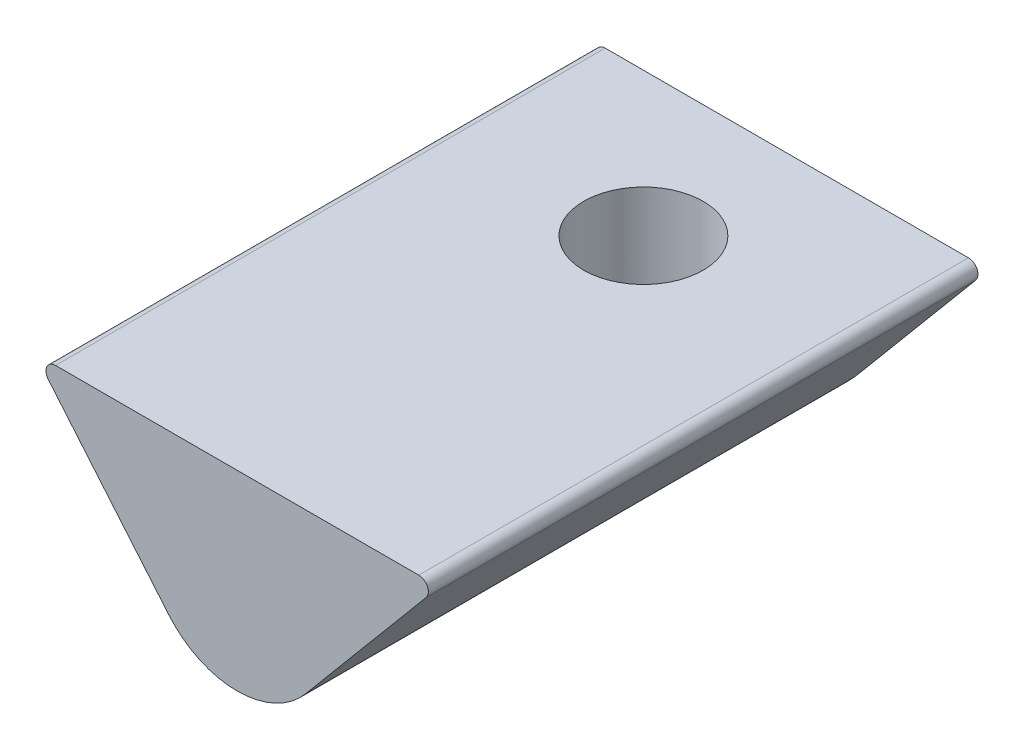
ISO-10303-21;
HEADER;
FILE_DESCRIPTION(('STEP AP214'),'2;1');
FILE_NAME('part.step','',(''),(''),'','','');
FILE_SCHEMA(('AUTOMOTIVE_DESIGN { 1 0 10303 214 1 1 1 1 }'));
ENDSEC;
DATA;
#1=APPLICATION_CONTEXT('core data for automotive mechanical design processes');
#2=APPLICATION_PROTOCOL_DEFINITION('international standard','automotive_design',2000,#1);
#3=PRODUCT_CONTEXT('',#1,'mechanical');
#4=PRODUCT('Part','Part','',(#3));
#5=PRODUCT_RELATED_PRODUCT_CATEGORY('part','',(#4));
#6=PRODUCT_DEFINITION_FORMATION('','',#4);
#7=PRODUCT_DEFINITION_CONTEXT('part definition',#1,'design');
#8=PRODUCT_DEFINITION('design','',#6,#7);
#9=PRODUCT_DEFINITION_SHAPE('','',#8);
#10=(LENGTH_UNIT() NAMED_UNIT(*) SI_UNIT(.MILLI.,.METRE.));
#11=(NAMED_UNIT(*) PLANE_ANGLE_UNIT() SI_UNIT($,.RADIAN.));
#12=(NAMED_UNIT(*) SI_UNIT($,.STERADIAN.) SOLID_ANGLE_UNIT());
#13=UNCERTAINTY_MEASURE_WITH_UNIT(LENGTH_MEASURE(1.E-05),#10,'distance_accuracy_value','');
#14=(GEOMETRIC_REPRESENTATION_CONTEXT(3) GLOBAL_UNCERTAINTY_ASSIGNED_CONTEXT((#13)) GLOBAL_UNIT_ASSIGNED_CONTEXT((#10,
#11,#12)) REPRESENTATION_CONTEXT('',''));
#15=CARTESIAN_POINT('',(0.,0.,0.));
#16=DIRECTION('',(0.,0.,1.));
#17=DIRECTION('',(1.,0.,0.));
#18=AXIS2_PLACEMENT_3D('',#15,#16,#17);
#19=CARTESIAN_POINT('',(0.,-2.1289115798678,11.5));
#20=DIRECTION('',(0.,0.,-1.));
#21=DIRECTION('',(-1.,0.,0.));
#22=AXIS2_PLACEMENT_3D('',#19,#20,#21);
#23=CYLINDRICAL_SURFACE('',#22,1.8710884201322);
#24=CARTESIAN_POINT('',(0.,-4.,4.24999999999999));
#25=CARTESIAN_POINT('',(0.0627778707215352,-4.0000005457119,4.25000064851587));
#26=CARTESIAN_POINT('',(0.125553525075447,-3.99681361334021,4.24524527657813));
#27=CARTESIAN_POINT('',(0.249101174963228,-3.98438454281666,4.22652207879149));
#28=CARTESIAN_POINT('',(0.309872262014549,-3.9751396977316,4.21255013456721));
#29=CARTESIAN_POINT('',(0.427443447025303,-3.95150521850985,4.17624989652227));
#30=CARTESIAN_POINT('',(0.484260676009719,-3.93713967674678,4.15396071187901));
#31=CARTESIAN_POINT('',(0.593117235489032,-3.90441677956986,4.10197741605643));
#32=CARTESIAN_POINT('',(0.645155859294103,-3.8860588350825,4.07228221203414));
#33=CARTESIAN_POINT('',(0.747972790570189,-3.84496175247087,4.00358347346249));
#34=CARTESIAN_POINT('',(0.798267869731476,-3.82198283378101,3.96400322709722));
#35=CARTESIAN_POINT('',(0.891962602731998,-3.77455392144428,3.87803937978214));
#36=CARTESIAN_POINT('',(0.93535216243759,-3.75010184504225,3.83164600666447));
#37=CARTESIAN_POINT('',(1.021038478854,-3.69778017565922,3.72483674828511));
#38=CARTESIAN_POINT('',(1.06207177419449,-3.66998325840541,3.66336381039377));
#39=CARTESIAN_POINT('',(1.13317828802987,-3.61847756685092,3.5328289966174));
#40=CARTESIAN_POINT('',(1.16327045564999,-3.59476176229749,3.46378051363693));
#41=CARTESIAN_POINT('',(1.20402510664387,-3.56131514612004,3.34020885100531));
#42=CARTESIAN_POINT('',(1.2177908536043,-3.54952325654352,3.28727268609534));
#43=CARTESIAN_POINT('',(1.23831292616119,-3.53167407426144,3.17915443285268));
#44=CARTESIAN_POINT('',(1.24508141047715,-3.52560683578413,3.12397641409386));
#45=CARTESIAN_POINT('',(1.25118327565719,-3.52014568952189,3.01263490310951));
#46=CARTESIAN_POINT('',(1.25048583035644,-3.52077944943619,2.95646828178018));
#47=CARTESIAN_POINT('',(1.24163315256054,-3.52867951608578,2.8451810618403));
#48=CARTESIAN_POINT('',(1.23347160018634,-3.53595144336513,2.79006139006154));
#49=CARTESIAN_POINT('',(1.2107577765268,-3.55553212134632,2.68482117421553));
#50=CARTESIAN_POINT('',(1.19650920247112,-3.56759981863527,2.63458728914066));
#51=CARTESIAN_POINT('',(1.16231254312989,-3.59536490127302,2.53718570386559));
#52=CARTESIAN_POINT('',(1.14236258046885,-3.61106348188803,2.4900190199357));
#53=CARTESIAN_POINT('',(1.09267832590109,-3.64817791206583,2.38984720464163));
#54=CARTESIAN_POINT('',(1.06177850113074,-3.67010686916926,2.33761202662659));
#55=CARTESIAN_POINT('',(0.993076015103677,-3.71524893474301,2.23845927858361));
#56=CARTESIAN_POINT('',(0.955264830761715,-3.73846360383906,2.19154839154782));
#57=CARTESIAN_POINT('',(0.864220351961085,-3.78944592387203,2.09391234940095));
#58=CARTESIAN_POINT('',(0.809421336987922,-3.81710628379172,2.04457487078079));
#59=CARTESIAN_POINT('',(0.690944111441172,-3.86895126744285,1.95569926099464));
#60=CARTESIAN_POINT('',(0.627274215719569,-3.89313910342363,1.91615204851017));
#61=CARTESIAN_POINT('',(0.505487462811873,-3.93132512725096,1.85515563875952));
#62=CARTESIAN_POINT('',(0.448722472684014,-3.94639107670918,1.83167924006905));
#63=CARTESIAN_POINT('',(0.331340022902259,-3.97140339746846,1.79313602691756));
#64=CARTESIAN_POINT('',(0.270725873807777,-3.98135410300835,1.7780620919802));
#65=CARTESIAN_POINT('',(0.146962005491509,-3.995262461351,1.75707748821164));
#66=CARTESIAN_POINT('',(0.0838024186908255,-3.99919390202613,1.75120689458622));
#67=CARTESIAN_POINT('',(-0.042749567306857,-4.00058090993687,1.74913019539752));
#68=CARTESIAN_POINT('',(-0.106141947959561,-3.99803698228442,1.75292333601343));
#69=CARTESIAN_POINT('',(-0.226594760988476,-3.98714349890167,1.76931445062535));
#70=CARTESIAN_POINT('',(-0.283784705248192,-3.97922010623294,1.78126643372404));
#71=CARTESIAN_POINT('',(-0.395154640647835,-3.95867491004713,1.81269088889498));
#72=CARTESIAN_POINT('',(-0.449334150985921,-3.94605235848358,1.83216455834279));
#73=CARTESIAN_POINT('',(-0.556777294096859,-3.91616227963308,1.87922197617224));
#74=CARTESIAN_POINT('',(-0.609792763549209,-3.89866227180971,1.90722079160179));
#75=CARTESIAN_POINT('',(-0.710546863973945,-3.86067352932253,1.96987947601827));
#76=CARTESIAN_POINT('',(-0.758282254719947,-3.84018297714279,2.0045433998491));
#77=CARTESIAN_POINT('',(-0.855111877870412,-3.79416323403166,2.08573256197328));
#78=CARTESIAN_POINT('',(-0.903225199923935,-3.76834987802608,2.13326679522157));
#79=CARTESIAN_POINT('',(-0.991231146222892,-3.716689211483,2.23546524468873));
#80=CARTESIAN_POINT('',(-1.03111790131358,-3.69084188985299,2.29013450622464));
#81=CARTESIAN_POINT('',(-1.09908345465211,-3.64369086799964,2.40132712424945));
#82=CARTESIAN_POINT('',(-1.12785860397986,-3.62218861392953,2.457338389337));
#83=CARTESIAN_POINT('',(-1.1770115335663,-3.58376296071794,2.57437771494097));
#84=CARTESIAN_POINT('',(-1.1974044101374,-3.56683134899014,2.63539651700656));
#85=CARTESIAN_POINT('',(-1.2258654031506,-3.54259897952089,2.74986440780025));
#86=CARTESIAN_POINT('',(-1.23550301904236,-3.53410491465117,2.80266434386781));
#87=CARTESIAN_POINT('',(-1.24789051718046,-3.52311890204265,2.90966125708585));
#88=CARTESIAN_POINT('',(-1.25064806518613,-3.52062027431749,2.96385661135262));
#89=CARTESIAN_POINT('',(-1.24909338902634,-3.52201529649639,3.07209703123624));
#90=CARTESIAN_POINT('',(-1.24477612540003,-3.52591350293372,3.12614196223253));
#91=CARTESIAN_POINT('',(-1.22936059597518,-3.53949491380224,3.23253268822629));
#92=CARTESIAN_POINT('',(-1.21825326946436,-3.5491858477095,3.28487611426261));
#93=CARTESIAN_POINT('',(-1.18608990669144,-3.57622226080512,3.40020006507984));
#94=CARTESIAN_POINT('',(-1.16318190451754,-3.5949128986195,3.46234214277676));
#95=CARTESIAN_POINT('',(-1.10864901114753,-3.63657328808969,3.5811061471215));
#96=CARTESIAN_POINT('',(-1.07701185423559,-3.6595490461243,3.6377201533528));
#97=CARTESIAN_POINT('',(-1.00519376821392,-3.70766439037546,3.74590589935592));
#98=CARTESIAN_POINT('',(-0.964866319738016,-3.73283601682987,3.79736567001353));
#99=CARTESIAN_POINT('',(-0.876573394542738,-3.78274515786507,3.89352160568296));
#100=CARTESIAN_POINT('',(-0.828605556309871,-3.80748253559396,3.93821567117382));
#101=CARTESIAN_POINT('',(-0.717887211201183,-3.8580255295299,4.02607892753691));
#102=CARTESIAN_POINT('',(-0.654000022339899,-3.88345207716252,4.06805450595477));
#103=CARTESIAN_POINT('',(-0.517977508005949,-3.9282923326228,4.14021829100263));
#104=CARTESIAN_POINT('',(-0.445854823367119,-3.94771509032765,4.17042425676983));
#105=CARTESIAN_POINT('',(-0.311516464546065,-3.97487736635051,4.2121505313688));
#106=CARTESIAN_POINT('',(-0.250429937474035,-3.98421877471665,4.22627117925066));
#107=CARTESIAN_POINT('',(-0.126227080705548,-3.99677736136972,4.24519184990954));
#108=CARTESIAN_POINT('',(-0.0631124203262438,-3.99999945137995,4.24999934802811));
#109=CARTESIAN_POINT('',(0.,-4.,4.24999999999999));
#110=B_SPLINE_CURVE_WITH_KNOTS('',3,(#24,#25,#26,#27,#28,#29,#30,#31,#32,#33,#34,#35,#36,#37,
#38,#39,#40,#41,#42,#43,#44,#45,#46,#47,#48,#49,#50,#51,#52,#53,#54,#55,#56,#57,#58,#59,#60,#61,
#62,#63,#64,#65,#66,#67,#68,#69,#70,#71,#72,#73,#74,#75,#76,#77,#78,#79,#80,#81,#82,#83,#84,#85,
#86,#87,#88,#89,#90,#91,#92,#93,#94,#95,#96,#97,#98,#99,#100,#101,#102,#103,#104,#105,#106,#107,
#108,#109),.UNSPECIFIED.,.T.,.F.,(4,2,2,2,2,2,2,2,2,2,2,2,2,2,2,2,2,2,2,2,2,2,2,2,2,2,2,2,2,2,2,
2,2,2,2,2,2,2,2,2,2,2,4),(0.,0.188079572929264,0.376243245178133,0.56353306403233,
0.750850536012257,0.954092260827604,1.15762839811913,1.39342787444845,1.62881699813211,
1.79601365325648,1.96291929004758,2.13051433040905,2.29825140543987,2.45845001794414,
2.61870144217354,2.81162152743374,3.00478114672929,3.23993087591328,3.47486165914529,
3.66381484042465,3.85260765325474,4.04222028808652,4.2318181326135,4.40791949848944,
4.58404890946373,4.7707024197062,4.95746984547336,5.1738000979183,5.39028415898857,
5.58916793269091,5.78769193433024,5.95000803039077,6.11214319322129,6.27439389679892,
6.43686158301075,6.64220653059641,6.84784149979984,7.05726085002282,7.26674505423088,
7.50707570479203,7.74704230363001,7.93627612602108,8.12535799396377),.UNSPECIFIED.);
#111=CARTESIAN_POINT('',(0.,-4.,4.24999999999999));
#112=VERTEX_POINT('',#111);
#113=EDGE_CURVE('E11',#112,#112,#110,.T.);
#114=ORIENTED_EDGE('',*,*,#113,.T.);
#115=EDGE_LOOP('',(#114));
#116=FACE_BOUND('',#115,.T.);
#117=CARTESIAN_POINT('',(0.,-2.1289115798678,0.));
#118=DIRECTION('',(0.,0.,1.));
#119=DIRECTION('',(-1.,0.,0.));
#120=AXIS2_PLACEMENT_3D('',#117,#118,#119);
#121=CIRCLE('',#120,1.8710884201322);
#122=CARTESIAN_POINT('',(-1.43333688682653,-3.33162403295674,0.));
#123=VERTEX_POINT('',#122);
#124=CARTESIAN_POINT('',(1.43333688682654,-3.33162403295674,0.));
#125=VERTEX_POINT('',#124);
#126=EDGE_CURVE('E87',#123,#125,#121,.T.);
#127=ORIENTED_EDGE('',*,*,#126,.T.);
#128=DIRECTION('',(0.,0.,-1.));
#129=VECTOR('',#128,1.);
#130=CARTESIAN_POINT('',(1.43333688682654,-3.33162403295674,11.5));
#131=LINE('',#130,#129);
#132=CARTESIAN_POINT('',(1.43333688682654,-3.33162403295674,11.5));
#133=VERTEX_POINT('',#132);
#134=EDGE_CURVE('E49',#133,#125,#131,.T.);
#135=ORIENTED_EDGE('',*,*,#134,.F.);
#136=CARTESIAN_POINT('',(0.,-2.1289115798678,11.5));
#137=DIRECTION('',(0.,0.,1.));
#138=DIRECTION('',(1.,0.,0.));
#139=AXIS2_PLACEMENT_3D('',#136,#137,#138);
#140=CIRCLE('',#139,1.8710884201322);
#141=CARTESIAN_POINT('',(-1.43333688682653,-3.33162403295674,11.5));
#142=VERTEX_POINT('',#141);
#143=EDGE_CURVE('E93',#142,#133,#140,.T.);
#144=ORIENTED_EDGE('',*,*,#143,.F.);
#145=DIRECTION('',(0.,0.,-1.));
#146=VECTOR('',#145,1.);
#147=CARTESIAN_POINT('',(-1.43333688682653,-3.33162403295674,11.5));
#148=LINE('',#147,#146);
#149=EDGE_CURVE('E121',#142,#123,#148,.T.);
#150=ORIENTED_EDGE('',*,*,#149,.T.);
#151=EDGE_LOOP('',(#127,#135,#144,#150));
#152=FACE_BOUND('',#151,.T.);
#153=ADVANCED_FACE('F36',(#116,#152),#23,.T.);
#154=CARTESIAN_POINT('',(3.9532088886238,-0.328557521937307,11.5));
#155=DIRECTION('',(-0.766044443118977,0.642787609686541,0.));
#156=DIRECTION('',(-0.642787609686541,-0.766044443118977,0.));
#157=AXIS2_PLACEMENT_3D('',#154,#155,#156);
#158=PLANE('',#157);
#159=DIRECTION('',(0.642787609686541,0.766044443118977,0.));
#160=VECTOR('',#159,1.);
#161=CARTESIAN_POINT('',(3.9532088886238,-0.328557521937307,0.));
#162=LINE('',#161,#160);
#163=CARTESIAN_POINT('',(3.9532088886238,-0.328557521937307,0.));
#164=VERTEX_POINT('',#163);
#165=EDGE_CURVE('E126',#125,#164,#162,.T.);
#166=ORIENTED_EDGE('',*,*,#165,.T.);
#167=DIRECTION('',(0.,0.,-1.));
#168=VECTOR('',#167,1.);
#169=CARTESIAN_POINT('',(3.9532088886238,-0.328557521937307,11.5));
#170=LINE('',#169,#168);
#171=CARTESIAN_POINT('',(3.9532088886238,-0.328557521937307,11.5));
#172=VERTEX_POINT('',#171);
#173=EDGE_CURVE('E139',#172,#164,#170,.T.);
#174=ORIENTED_EDGE('',*,*,#173,.F.);
#175=DIRECTION('',(0.642787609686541,0.766044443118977,0.));
#176=VECTOR('',#175,1.);
#177=CARTESIAN_POINT('',(3.9532088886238,-0.328557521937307,11.5));
#178=LINE('',#177,#176);
#179=EDGE_CURVE('E146',#133,#172,#178,.T.);
#180=ORIENTED_EDGE('',*,*,#179,.F.);
#181=ORIENTED_EDGE('',*,*,#134,.T.);
#182=EDGE_LOOP('',(#166,#174,#180,#181));
#183=FACE_BOUND('',#182,.T.);
#184=ADVANCED_FACE('F144',(#183),#158,.F.);
#185=CARTESIAN_POINT('',(3.8,-0.199999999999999,11.5));
#186=DIRECTION('',(0.,0.,-1.));
#187=DIRECTION('',(-1.,0.,0.));
#188=AXIS2_PLACEMENT_3D('',#185,#186,#187);
#189=CYLINDRICAL_SURFACE('',#188,0.2);
#190=CARTESIAN_POINT('',(3.8,-0.199999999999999,0.));
#191=DIRECTION('',(0.,0.,1.));
#192=DIRECTION('',(1.,0.,0.));
#193=AXIS2_PLACEMENT_3D('',#190,#191,#192);
#194=CIRCLE('',#193,0.2);
#195=CARTESIAN_POINT('',(3.8,0.,0.));
#196=VERTEX_POINT('',#195);
#197=EDGE_CURVE('E129',#164,#196,#194,.T.);
#198=ORIENTED_EDGE('',*,*,#197,.T.);
#199=DIRECTION('',(0.,0.,-1.));
#200=VECTOR('',#199,1.);
#201=CARTESIAN_POINT('',(3.8,0.,11.5));
#202=LINE('',#201,#200);
#203=CARTESIAN_POINT('',(3.8,0.,11.5));
#204=VERTEX_POINT('',#203);
#205=EDGE_CURVE('E116',#204,#196,#202,.T.);
#206=ORIENTED_EDGE('',*,*,#205,.F.);
#207=CARTESIAN_POINT('',(3.8,-0.199999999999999,11.5));
#208=DIRECTION('',(0.,0.,1.));
#209=DIRECTION('',(1.,0.,0.));
#210=AXIS2_PLACEMENT_3D('',#207,#208,#209);
#211=CIRCLE('',#210,0.2);
#212=EDGE_CURVE('E107',#172,#204,#211,.T.);
#213=ORIENTED_EDGE('',*,*,#212,.F.);
#214=ORIENTED_EDGE('',*,*,#173,.T.);
#215=EDGE_LOOP('',(#198,#206,#213,#214));
#216=FACE_BOUND('',#215,.T.);
#217=ADVANCED_FACE('F151',(#216),#189,.T.);
#218=CARTESIAN_POINT('',(-3.8,0.,11.5));
#219=DIRECTION('',(0.,-1.,0.));
#220=DIRECTION('',(1.,0.,0.));
#221=AXIS2_PLACEMENT_3D('',#218,#219,#220);
#222=PLANE('',#221);
#223=CARTESIAN_POINT('',(0.,0.,3.));
#224=DIRECTION('',(0.,1.,0.));
#225=DIRECTION('',(0.,0.,1.));
#226=AXIS2_PLACEMENT_3D('',#223,#224,#225);
#227=CIRCLE('',#226,1.24999999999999);
#228=CARTESIAN_POINT('',(0.,0.,4.24999999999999));
#229=VERTEX_POINT('',#228);
#230=EDGE_CURVE('E127',#229,#229,#227,.T.);
#231=ORIENTED_EDGE('',*,*,#230,.F.);
#232=EDGE_LOOP('',(#231));
#233=FACE_BOUND('',#232,.T.);
#234=DIRECTION('',(-1.,0.,0.));
#235=VECTOR('',#234,1.);
#236=CARTESIAN_POINT('',(-3.8,0.,0.));
#237=LINE('',#236,#235);
#238=CARTESIAN_POINT('',(-3.8,0.,0.));
#239=VERTEX_POINT('',#238);
#240=EDGE_CURVE('E115',#196,#239,#237,.T.);
#241=ORIENTED_EDGE('',*,*,#240,.T.);
#242=DIRECTION('',(0.,0.,-1.));
#243=VECTOR('',#242,1.);
#244=CARTESIAN_POINT('',(-3.8,0.,11.5));
#245=LINE('',#244,#243);
#246=CARTESIAN_POINT('',(-3.8,0.,11.5));
#247=VERTEX_POINT('',#246);
#248=EDGE_CURVE('E112',#247,#239,#245,.T.);
#249=ORIENTED_EDGE('',*,*,#248,.F.);
#250=DIRECTION('',(-1.,0.,0.));
#251=VECTOR('',#250,1.);
#252=CARTESIAN_POINT('',(-3.8,0.,11.5));
#253=LINE('',#252,#251);
#254=EDGE_CURVE('E101',#204,#247,#253,.T.);
#255=ORIENTED_EDGE('',*,*,#254,.F.);
#256=ORIENTED_EDGE('',*,*,#205,.T.);
#257=EDGE_LOOP('',(#241,#249,#255,#256));
#258=FACE_BOUND('',#257,.T.);
#259=ADVANCED_FACE('F113',(#233,#258),#222,.F.);
#260=CARTESIAN_POINT('',(-3.8,-0.2,11.5));
#261=DIRECTION('',(0.,0.,-1.));
#262=DIRECTION('',(-1.,0.,0.));
#263=AXIS2_PLACEMENT_3D('',#260,#261,#262);
#264=CYLINDRICAL_SURFACE('',#263,0.2);
#265=CARTESIAN_POINT('',(-3.8,-0.2,0.));
#266=DIRECTION('',(0.,0.,1.));
#267=DIRECTION('',(-1.,0.,0.));
#268=AXIS2_PLACEMENT_3D('',#265,#266,#267);
#269=CIRCLE('',#268,0.2);
#270=CARTESIAN_POINT('',(-3.9532088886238,-0.328557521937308,0.));
#271=VERTEX_POINT('',#270);
#272=EDGE_CURVE('E80',#239,#271,#269,.T.);
#273=ORIENTED_EDGE('',*,*,#272,.T.);
#274=DIRECTION('',(0.,0.,-1.));
#275=VECTOR('',#274,1.);
#276=CARTESIAN_POINT('',(-3.9532088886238,-0.328557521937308,11.5));
#277=LINE('',#276,#275);
#278=CARTESIAN_POINT('',(-3.9532088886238,-0.328557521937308,11.5));
#279=VERTEX_POINT('',#278);
#280=EDGE_CURVE('E117',#279,#271,#277,.T.);
#281=ORIENTED_EDGE('',*,*,#280,.F.);
#282=CARTESIAN_POINT('',(-3.8,-0.2,11.5));
#283=DIRECTION('',(0.,0.,1.));
#284=DIRECTION('',(-1.,0.,0.));
#285=AXIS2_PLACEMENT_3D('',#282,#283,#284);
#286=CIRCLE('',#285,0.2);
#287=EDGE_CURVE('E105',#247,#279,#286,.T.);
#288=ORIENTED_EDGE('',*,*,#287,.F.);
#289=ORIENTED_EDGE('',*,*,#248,.T.);
#290=EDGE_LOOP('',(#273,#281,#288,#289));
#291=FACE_BOUND('',#290,.T.);
#292=ADVANCED_FACE('F119',(#291),#264,.T.);
#293=CARTESIAN_POINT('',(-3.9532088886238,-0.328557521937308,11.5));
#294=DIRECTION('',(0.766044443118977,0.642787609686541,0.));
#295=DIRECTION('',(-0.642787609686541,0.766044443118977,0.));
#296=AXIS2_PLACEMENT_3D('',#293,#294,#295);
#297=PLANE('',#296);
#298=DIRECTION('',(0.642787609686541,-0.766044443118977,0.));
#299=VECTOR('',#298,1.);
#300=CARTESIAN_POINT('',(-3.9532088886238,-0.328557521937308,0.));
#301=LINE('',#300,#299);
#302=EDGE_CURVE('E133',#271,#123,#301,.T.);
#303=ORIENTED_EDGE('',*,*,#302,.T.);
#304=ORIENTED_EDGE('',*,*,#149,.F.);
#305=DIRECTION('',(0.642787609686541,-0.766044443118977,0.));
#306=VECTOR('',#305,1.);
#307=CARTESIAN_POINT('',(-3.9532088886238,-0.328557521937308,11.5));
#308=LINE('',#307,#306);
#309=EDGE_CURVE('E57',#279,#142,#308,.T.);
#310=ORIENTED_EDGE('',*,*,#309,.F.);
#311=ORIENTED_EDGE('',*,*,#280,.T.);
#312=EDGE_LOOP('',(#303,#304,#310,#311));
#313=FACE_BOUND('',#312,.T.);
#314=ADVANCED_FACE('F167',(#313),#297,.F.);
#315=CARTESIAN_POINT('',(0.,-2.1289115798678,11.5));
#316=DIRECTION('',(0.,0.,1.));
#317=DIRECTION('',(1.,0.,0.));
#318=AXIS2_PLACEMENT_3D('',#315,#316,#317);
#319=PLANE('',#318);
#320=ORIENTED_EDGE('',*,*,#143,.T.);
#321=ORIENTED_EDGE('',*,*,#179,.T.);
#322=ORIENTED_EDGE('',*,*,#212,.T.);
#323=ORIENTED_EDGE('',*,*,#254,.T.);
#324=ORIENTED_EDGE('',*,*,#287,.T.);
#325=ORIENTED_EDGE('',*,*,#309,.T.);
#326=EDGE_LOOP('',(#320,#321,#322,#323,#324,#325));
#327=FACE_BOUND('',#326,.T.);
#328=ADVANCED_FACE('F103',(#327),#319,.T.);
#329=CARTESIAN_POINT('',(0.,-2.1289115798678,0.));
#330=DIRECTION('',(0.,0.,1.));
#331=DIRECTION('',(1.,0.,0.));
#332=AXIS2_PLACEMENT_3D('',#329,#330,#331);
#333=PLANE('',#332);
#334=ORIENTED_EDGE('',*,*,#126,.F.);
#335=ORIENTED_EDGE('',*,*,#302,.F.);
#336=ORIENTED_EDGE('',*,*,#272,.F.);
#337=ORIENTED_EDGE('',*,*,#240,.F.);
#338=ORIENTED_EDGE('',*,*,#197,.F.);
#339=ORIENTED_EDGE('',*,*,#165,.F.);
#340=EDGE_LOOP('',(#334,#335,#336,#337,#338,#339));
#341=FACE_BOUND('',#340,.T.);
#342=ADVANCED_FACE('F149',(#341),#333,.F.);
#343=CARTESIAN_POINT('',(0.,0.,3.));
#344=DIRECTION('',(0.,1.,0.));
#345=DIRECTION('',(0.,0.,1.));
#346=AXIS2_PLACEMENT_3D('',#343,#344,#345);
#347=CYLINDRICAL_SURFACE('',#346,1.24999999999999);
#348=ORIENTED_EDGE('',*,*,#230,.T.);
#349=EDGE_LOOP('',(#348));
#350=FACE_BOUND('',#349,.T.);
#351=ORIENTED_EDGE('',*,*,#113,.F.);
#352=EDGE_LOOP('',(#351));
#353=FACE_BOUND('',#352,.T.);
#354=ADVANCED_FACE('F158',(#350,#353),#347,.F.);
#355=CLOSED_SHELL('',(#153,#184,#217,#259,#292,#314,#328,#342,#354));
#356=MANIFOLD_SOLID_BREP('B2',#355);
#357=ADVANCED_BREP_SHAPE_REPRESENTATION('',(#18,#356),#14);
#358=SHAPE_DEFINITION_REPRESENTATION(#9,#357);
ENDSEC;
END-ISO-10303-21;
